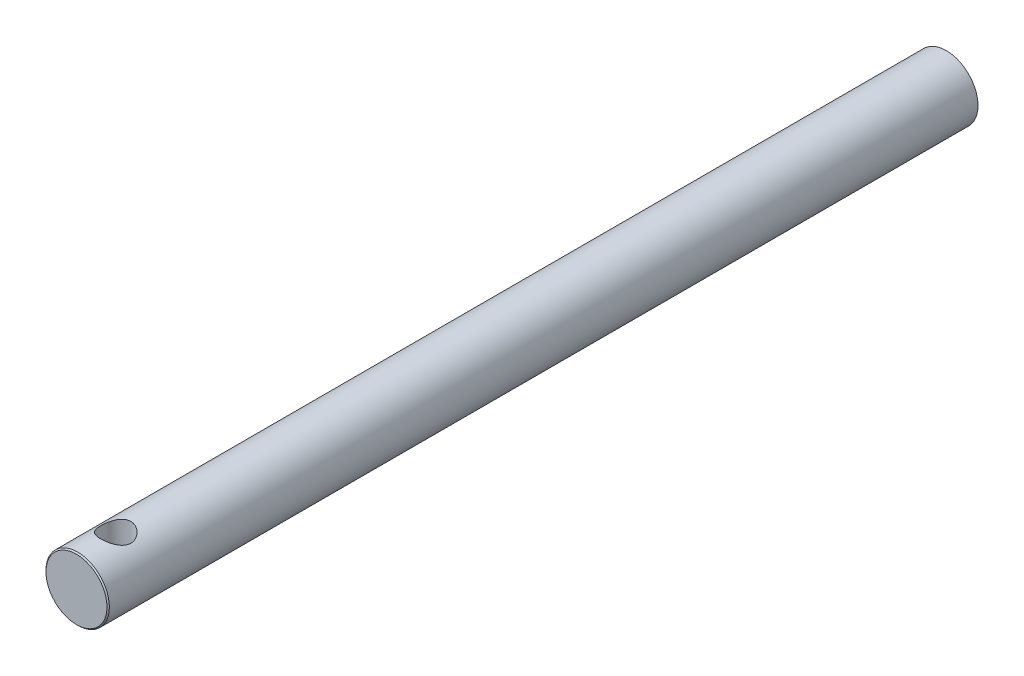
ISO-10303-21;
HEADER;
FILE_DESCRIPTION(('STEP AP214'),'2;1');
FILE_NAME('part.step','',(''),(''),'','','');
FILE_SCHEMA(('AUTOMOTIVE_DESIGN { 1 0 10303 214 1 1 1 1 }'));
ENDSEC;
DATA;
#1=APPLICATION_CONTEXT('core data for automotive mechanical design processes');
#2=APPLICATION_PROTOCOL_DEFINITION('international standard','automotive_design',2000,#1);
#3=PRODUCT_CONTEXT('',#1,'mechanical');
#4=PRODUCT('Part','Part','',(#3));
#5=PRODUCT_RELATED_PRODUCT_CATEGORY('part','',(#4));
#6=PRODUCT_DEFINITION_FORMATION('','',#4);
#7=PRODUCT_DEFINITION_CONTEXT('part definition',#1,'design');
#8=PRODUCT_DEFINITION('design','',#6,#7);
#9=PRODUCT_DEFINITION_SHAPE('','',#8);
#10=(LENGTH_UNIT() NAMED_UNIT(*) SI_UNIT(.MILLI.,.METRE.));
#11=(NAMED_UNIT(*) PLANE_ANGLE_UNIT() SI_UNIT($,.RADIAN.));
#12=(NAMED_UNIT(*) SI_UNIT($,.STERADIAN.) SOLID_ANGLE_UNIT());
#13=UNCERTAINTY_MEASURE_WITH_UNIT(LENGTH_MEASURE(1.E-05),#10,'distance_accuracy_value','');
#14=(GEOMETRIC_REPRESENTATION_CONTEXT(3) GLOBAL_UNCERTAINTY_ASSIGNED_CONTEXT((#13)) GLOBAL_UNIT_ASSIGNED_CONTEXT((#10,
#11,#12)) REPRESENTATION_CONTEXT('',''));
#15=CARTESIAN_POINT('',(0.,0.,0.));
#16=DIRECTION('',(0.,0.,1.));
#17=DIRECTION('',(1.,0.,0.));
#18=AXIS2_PLACEMENT_3D('',#15,#16,#17);
#19=CARTESIAN_POINT('',(0.,0.,144.));
#20=DIRECTION('',(0.,0.,-1.));
#21=DIRECTION('',(-1.,0.,0.));
#22=AXIS2_PLACEMENT_3D('',#19,#20,#21);
#23=CYLINDRICAL_SURFACE('',#22,5.25);
#24=CARTESIAN_POINT('',(0.,-5.25,140.));
#25=CARTESIAN_POINT('',(0.132165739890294,-5.24999266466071,139.999991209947));
#26=CARTESIAN_POINT('',(0.264515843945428,-5.24495416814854,139.989456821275));
#27=CARTESIAN_POINT('',(0.525348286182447,-5.22529487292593,139.947760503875));
#28=CARTESIAN_POINT('',(0.653821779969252,-5.21065367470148,139.916554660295));
#29=CARTESIAN_POINT('',(0.902724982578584,-5.17333218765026,139.834988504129));
#30=CARTESIAN_POINT('',(1.02318293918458,-5.15068212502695,139.784700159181));
#31=CARTESIAN_POINT('',(1.25379564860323,-5.09945780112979,139.666745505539));
#32=CARTESIAN_POINT('',(1.36395186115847,-5.07088438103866,139.599081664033));
#33=CARTESIAN_POINT('',(1.57782560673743,-5.00859887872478,139.443936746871));
#34=CARTESIAN_POINT('',(1.68082998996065,-4.97468790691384,139.355553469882));
#35=CARTESIAN_POINT('',(1.8711994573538,-4.90625773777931,139.163407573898));
#36=CARTESIAN_POINT('',(1.9585538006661,-4.87173814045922,139.059634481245));
#37=CARTESIAN_POINT('',(2.12112928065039,-4.80329266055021,138.831087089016));
#38=CARTESIAN_POINT('',(2.19510684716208,-4.76956998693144,138.705360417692));
#39=CARTESIAN_POINT('',(2.32055549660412,-4.70981783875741,138.441449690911));
#40=CARTESIAN_POINT('',(2.37204145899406,-4.68378328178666,138.303273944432));
#41=CARTESIAN_POINT('',(2.44789372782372,-4.64457285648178,138.026499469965));
#42=CARTESIAN_POINT('',(2.47364073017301,-4.63074762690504,137.888375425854));
#43=CARTESIAN_POINT('',(2.50154637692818,-4.61573890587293,137.609131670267));
#44=CARTESIAN_POINT('',(2.50372468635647,-4.61454487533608,137.468014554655));
#45=CARTESIAN_POINT('',(2.48545049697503,-4.62440209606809,137.202828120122));
#46=CARTESIAN_POINT('',(2.46737110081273,-4.63416946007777,137.07853657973));
#47=CARTESIAN_POINT('',(2.41316672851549,-4.66262302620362,136.835024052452));
#48=CARTESIAN_POINT('',(2.37703683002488,-4.68131166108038,136.71580445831));
#49=CARTESIAN_POINT('',(2.28705880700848,-4.72593088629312,136.482468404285));
#50=CARTESIAN_POINT('',(2.23281876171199,-4.75201955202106,136.368534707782));
#51=CARTESIAN_POINT('',(2.1084508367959,-4.80849184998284,136.150864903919));
#52=CARTESIAN_POINT('',(2.0383159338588,-4.8388773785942,136.047133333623));
#53=CARTESIAN_POINT('',(1.8748403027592,-4.90469972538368,135.840406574));
#54=CARTESIAN_POINT('',(1.7797685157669,-4.94031825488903,135.738833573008));
#55=CARTESIAN_POINT('',(1.57372196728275,-5.00976222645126,135.552514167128));
#56=CARTESIAN_POINT('',(1.46274093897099,-5.04358695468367,135.46777442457));
#57=CARTESIAN_POINT('',(1.22256421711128,-5.10723352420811,135.314505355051));
#58=CARTESIAN_POINT('',(1.09283185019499,-5.13685117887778,135.246725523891));
#59=CARTESIAN_POINT('',(0.822034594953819,-5.18706700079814,135.134477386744));
#60=CARTESIAN_POINT('',(0.680977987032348,-5.20767168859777,135.089992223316));
#61=CARTESIAN_POINT('',(0.403257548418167,-5.23620488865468,135.02896653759));
#62=CARTESIAN_POINT('',(0.26709931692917,-5.24499140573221,135.010528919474));
#63=CARTESIAN_POINT('',(-0.0066428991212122,-5.25177773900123,134.996259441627));
#64=CARTESIAN_POINT('',(-0.144226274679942,-5.24978198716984,135.000418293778));
#65=CARTESIAN_POINT('',(-0.406878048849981,-5.23574931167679,135.030037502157));
#66=CARTESIAN_POINT('',(-0.532156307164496,-5.22441255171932,135.054012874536));
#67=CARTESIAN_POINT('',(-0.776694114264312,-5.19369239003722,135.120335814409));
#68=CARTESIAN_POINT('',(-0.895952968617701,-5.17430806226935,135.162685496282));
#69=CARTESIAN_POINT('',(-1.12919909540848,-5.12854456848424,135.265796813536));
#70=CARTESIAN_POINT('',(-1.24291822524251,-5.10197175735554,135.327076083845));
#71=CARTESIAN_POINT('',(-1.45885691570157,-5.04447644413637,135.465738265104));
#72=CARTESIAN_POINT('',(-1.56107140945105,-5.01355203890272,135.543128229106));
#73=CARTESIAN_POINT('',(-1.7609227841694,-4.94709242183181,135.71996279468));
#74=CARTESIAN_POINT('',(-1.85730015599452,-4.91139355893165,135.820772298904));
#75=CARTESIAN_POINT('',(-2.03227648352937,-4.8416159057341,136.037382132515));
#76=CARTESIAN_POINT('',(-2.11086592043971,-4.80753799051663,136.153190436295));
#77=CARTESIAN_POINT('',(-2.25066382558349,-4.74374815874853,136.402002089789));
#78=CARTESIAN_POINT('',(-2.31112889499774,-4.71424227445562,136.535480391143));
#79=CARTESIAN_POINT('',(-2.40810079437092,-4.66546299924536,136.812590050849));
#80=CARTESIAN_POINT('',(-2.44463543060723,-4.64617773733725,136.956209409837));
#81=CARTESIAN_POINT('',(-2.48958734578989,-4.6222337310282,137.235316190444));
#82=CARTESIAN_POINT('',(-2.50028494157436,-4.61639115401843,137.370333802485));
#83=CARTESIAN_POINT('',(-2.49970377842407,-4.61670761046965,137.640287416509));
#84=CARTESIAN_POINT('',(-2.48843199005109,-4.6228628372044,137.775223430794));
#85=CARTESIAN_POINT('',(-2.44630990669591,-4.64527247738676,138.030028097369));
#86=CARTESIAN_POINT('',(-2.41707425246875,-4.66069188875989,138.150245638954));
#87=CARTESIAN_POINT('',(-2.34171895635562,-4.69900293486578,138.383992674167));
#88=CARTESIAN_POINT('',(-2.29559419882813,-4.72189683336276,138.497520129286));
#89=CARTESIAN_POINT('',(-2.18428055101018,-4.77445699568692,138.723017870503));
#90=CARTESIAN_POINT('',(-2.11802371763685,-4.80447357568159,138.834377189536));
#91=CARTESIAN_POINT('',(-1.96959609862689,-4.86720488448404,139.045095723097));
#92=CARTESIAN_POINT('',(-1.88741759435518,-4.89992091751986,139.144449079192));
#93=CARTESIAN_POINT('',(-1.69920061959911,-4.9685271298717,139.339277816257));
#94=CARTESIAN_POINT('',(-1.59155520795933,-5.00438550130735,139.433221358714));
#95=CARTESIAN_POINT('',(-1.36093741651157,-5.07196241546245,139.601972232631));
#96=CARTESIAN_POINT('',(-1.23795758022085,-5.10367892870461,139.676770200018));
#97=CARTESIAN_POINT('',(-0.97969740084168,-5.15945932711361,139.804525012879));
#98=CARTESIAN_POINT('',(-0.844445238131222,-5.18354020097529,139.857530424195));
#99=CARTESIAN_POINT('',(-0.635554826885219,-5.21186570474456,139.918957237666));
#100=CARTESIAN_POINT('',(-0.564978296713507,-5.22000502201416,139.936412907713));
#101=CARTESIAN_POINT('',(-0.42232921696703,-5.23347401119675,139.965140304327));
#102=CARTESIAN_POINT('',(-0.350257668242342,-5.23880550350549,139.976416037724));
#103=CARTESIAN_POINT('',(-0.231703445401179,-5.24508772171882,139.989671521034));
#104=CARTESIAN_POINT('',(-0.185468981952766,-5.24692689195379,139.993541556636));
#105=CARTESIAN_POINT('',(-0.0928305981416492,-5.24938433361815,139.998707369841));
#106=CARTESIAN_POINT('',(-0.0464266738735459,-5.25000257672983,140.000003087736));
#107=CARTESIAN_POINT('',(0.,-5.25,140.));
#108=B_SPLINE_CURVE_WITH_KNOTS('',3,(#24,#25,#26,#27,#28,#29,#30,#31,#32,#33,#34,#35,#36,#37,
#38,#39,#40,#41,#42,#43,#44,#45,#46,#47,#48,#49,#50,#51,#52,#53,#54,#55,#56,#57,#58,#59,#60,#61,
#62,#63,#64,#65,#66,#67,#68,#69,#70,#71,#72,#73,#74,#75,#76,#77,#78,#79,#80,#81,#82,#83,#84,#85,
#86,#87,#88,#89,#90,#91,#92,#93,#94,#95,#96,#97,#98,#99,#100,#101,#102,#103,#104,#105,#106,
#107),.UNSPECIFIED.,.T.,.F.,(4,2,2,2,2,2,2,2,2,2,2,2,2,2,2,2,2,2,2,2,2,2,2,2,2,2,2,2,2,2,2,2,2,
2,2,2,2,2,2,2,2,4),(0.,0.396316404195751,0.793477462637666,1.18915532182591,1.5847770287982,
2.00270353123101,2.42091577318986,2.86781990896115,3.31442794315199,3.73553405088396,
4.15628877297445,4.53246793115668,4.90874972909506,5.29376840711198,5.6789575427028,
6.10790232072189,6.53701653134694,6.98264766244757,7.42795586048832,7.83878281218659,
8.24944090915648,8.63185033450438,9.01430377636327,9.40831258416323,9.80249424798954,
10.2324870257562,10.6627093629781,11.1087146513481,11.5542007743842,11.9586449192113,
12.362960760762,12.7353812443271,13.1079146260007,13.5053412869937,13.9029610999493,
14.3427993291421,14.7828522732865,15.2219191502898,15.4411213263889,15.6601812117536,
15.7993944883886,15.9386109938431),.UNSPECIFIED.);
#109=CARTESIAN_POINT('',(0.,-5.25,140.));
#110=VERTEX_POINT('',#109);
#111=EDGE_CURVE('E10',#110,#110,#108,.T.);
#112=ORIENTED_EDGE('',*,*,#111,.T.);
#113=EDGE_LOOP('',(#112));
#114=FACE_BOUND('',#113,.T.);
#115=CARTESIAN_POINT('',(0.,5.25,140.));
#116=CARTESIAN_POINT('',(-0.132165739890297,5.2499926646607,139.999991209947));
#117=CARTESIAN_POINT('',(-0.26451584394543,5.24495416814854,139.989456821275));
#118=CARTESIAN_POINT('',(-0.525348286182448,5.22529487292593,139.947760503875));
#119=CARTESIAN_POINT('',(-0.653821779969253,5.21065367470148,139.916554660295));
#120=CARTESIAN_POINT('',(-0.902724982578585,5.17333218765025,139.834988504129));
#121=CARTESIAN_POINT('',(-1.02318293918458,5.15068212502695,139.784700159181));
#122=CARTESIAN_POINT('',(-1.25379564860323,5.09945780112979,139.666745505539));
#123=CARTESIAN_POINT('',(-1.36395186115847,5.07088438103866,139.599081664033));
#124=CARTESIAN_POINT('',(-1.57782560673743,5.00859887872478,139.443936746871));
#125=CARTESIAN_POINT('',(-1.68082998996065,4.97468790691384,139.355553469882));
#126=CARTESIAN_POINT('',(-1.87119945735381,4.90625773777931,139.163407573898));
#127=CARTESIAN_POINT('',(-1.9585538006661,4.87173814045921,139.059634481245));
#128=CARTESIAN_POINT('',(-2.12112928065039,4.80329266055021,138.831087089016));
#129=CARTESIAN_POINT('',(-2.19510684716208,4.76956998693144,138.705360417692));
#130=CARTESIAN_POINT('',(-2.32055549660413,4.70981783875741,138.441449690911));
#131=CARTESIAN_POINT('',(-2.37204145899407,4.68378328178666,138.303273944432));
#132=CARTESIAN_POINT('',(-2.44789372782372,4.64457285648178,138.026499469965));
#133=CARTESIAN_POINT('',(-2.47364073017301,4.63074762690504,137.888375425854));
#134=CARTESIAN_POINT('',(-2.50154637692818,4.61573890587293,137.609131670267));
#135=CARTESIAN_POINT('',(-2.50372468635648,4.61454487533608,137.468014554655));
#136=CARTESIAN_POINT('',(-2.48545049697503,4.62440209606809,137.202828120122));
#137=CARTESIAN_POINT('',(-2.46737110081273,4.63416946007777,137.07853657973));
#138=CARTESIAN_POINT('',(-2.41316672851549,4.66262302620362,136.835024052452));
#139=CARTESIAN_POINT('',(-2.37703683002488,4.68131166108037,136.71580445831));
#140=CARTESIAN_POINT('',(-2.28705880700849,4.72593088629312,136.482468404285));
#141=CARTESIAN_POINT('',(-2.232818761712,4.75201955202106,136.368534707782));
#142=CARTESIAN_POINT('',(-2.1084508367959,4.80849184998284,136.150864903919));
#143=CARTESIAN_POINT('',(-2.0383159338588,4.8388773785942,136.047133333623));
#144=CARTESIAN_POINT('',(-1.87484030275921,4.90469972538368,135.840406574));
#145=CARTESIAN_POINT('',(-1.77976851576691,4.94031825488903,135.738833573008));
#146=CARTESIAN_POINT('',(-1.57372196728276,5.00976222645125,135.552514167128));
#147=CARTESIAN_POINT('',(-1.462740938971,5.04358695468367,135.46777442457));
#148=CARTESIAN_POINT('',(-1.22256421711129,5.10723352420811,135.314505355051));
#149=CARTESIAN_POINT('',(-1.092831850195,5.13685117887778,135.246725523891));
#150=CARTESIAN_POINT('',(-0.822034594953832,5.18706700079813,135.134477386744));
#151=CARTESIAN_POINT('',(-0.680977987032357,5.20767168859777,135.089992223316));
#152=CARTESIAN_POINT('',(-0.403257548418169,5.23620488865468,135.02896653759));
#153=CARTESIAN_POINT('',(-0.267099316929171,5.24499140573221,135.010528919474));
#154=CARTESIAN_POINT('',(0.00664289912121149,5.25177773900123,134.996259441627));
#155=CARTESIAN_POINT('',(0.144226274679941,5.24978198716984,135.000418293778));
#156=CARTESIAN_POINT('',(0.406878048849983,5.23574931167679,135.030037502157));
#157=CARTESIAN_POINT('',(0.5321563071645,5.22441255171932,135.054012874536));
#158=CARTESIAN_POINT('',(0.776694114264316,5.19369239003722,135.120335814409));
#159=CARTESIAN_POINT('',(0.895952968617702,5.17430806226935,135.162685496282));
#160=CARTESIAN_POINT('',(1.12919909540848,5.12854456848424,135.265796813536));
#161=CARTESIAN_POINT('',(1.24291822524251,5.10197175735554,135.327076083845));
#162=CARTESIAN_POINT('',(1.45885691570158,5.04447644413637,135.465738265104));
#163=CARTESIAN_POINT('',(1.56107140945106,5.01355203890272,135.543128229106));
#164=CARTESIAN_POINT('',(1.7609227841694,4.94709242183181,135.71996279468));
#165=CARTESIAN_POINT('',(1.85730015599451,4.91139355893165,135.820772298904));
#166=CARTESIAN_POINT('',(2.03227648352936,4.84161590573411,136.037382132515));
#167=CARTESIAN_POINT('',(2.1108659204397,4.80753799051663,136.153190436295));
#168=CARTESIAN_POINT('',(2.25066382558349,4.74374815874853,136.402002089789));
#169=CARTESIAN_POINT('',(2.31112889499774,4.71424227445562,136.535480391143));
#170=CARTESIAN_POINT('',(2.40810079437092,4.66546299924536,136.812590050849));
#171=CARTESIAN_POINT('',(2.44463543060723,4.64617773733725,136.956209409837));
#172=CARTESIAN_POINT('',(2.48958734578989,4.6222337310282,137.235316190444));
#173=CARTESIAN_POINT('',(2.50028494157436,4.61639115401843,137.370333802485));
#174=CARTESIAN_POINT('',(2.49970377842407,4.61670761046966,137.640287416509));
#175=CARTESIAN_POINT('',(2.48843199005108,4.6228628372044,137.775223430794));
#176=CARTESIAN_POINT('',(2.4463099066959,4.64527247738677,138.030028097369));
#177=CARTESIAN_POINT('',(2.41707425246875,4.66069188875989,138.150245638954));
#178=CARTESIAN_POINT('',(2.34171895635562,4.69900293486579,138.383992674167));
#179=CARTESIAN_POINT('',(2.29559419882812,4.72189683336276,138.497520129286));
#180=CARTESIAN_POINT('',(2.18428055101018,4.77445699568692,138.723017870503));
#181=CARTESIAN_POINT('',(2.11802371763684,4.80447357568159,138.834377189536));
#182=CARTESIAN_POINT('',(1.96959609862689,4.86720488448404,139.045095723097));
#183=CARTESIAN_POINT('',(1.88741759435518,4.89992091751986,139.144449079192));
#184=CARTESIAN_POINT('',(1.69920061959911,4.9685271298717,139.339277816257));
#185=CARTESIAN_POINT('',(1.59155520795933,5.00438550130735,139.433221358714));
#186=CARTESIAN_POINT('',(1.36093741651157,5.07196241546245,139.601972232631));
#187=CARTESIAN_POINT('',(1.23795758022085,5.10367892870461,139.676770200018));
#188=CARTESIAN_POINT('',(0.979697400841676,5.15945932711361,139.804525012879));
#189=CARTESIAN_POINT('',(0.844445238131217,5.18354020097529,139.857530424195));
#190=CARTESIAN_POINT('',(0.635554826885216,5.21186570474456,139.918957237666));
#191=CARTESIAN_POINT('',(0.564978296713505,5.22000502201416,139.936412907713));
#192=CARTESIAN_POINT('',(0.422329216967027,5.23347401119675,139.965140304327));
#193=CARTESIAN_POINT('',(0.350257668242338,5.23880550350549,139.976416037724));
#194=CARTESIAN_POINT('',(0.231703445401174,5.24508772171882,139.989671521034));
#195=CARTESIAN_POINT('',(0.185468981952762,5.24692689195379,139.993541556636));
#196=CARTESIAN_POINT('',(0.092830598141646,5.24938433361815,139.998707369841));
#197=CARTESIAN_POINT('',(0.0464266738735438,5.25000257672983,140.000003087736));
#198=CARTESIAN_POINT('',(0.,5.25,140.));
#199=B_SPLINE_CURVE_WITH_KNOTS('',3,(#115,#116,#117,#118,#119,#120,#121,#122,#123,#124,#125,
#126,#127,#128,#129,#130,#131,#132,#133,#134,#135,#136,#137,#138,#139,#140,#141,#142,#143,#144,
#145,#146,#147,#148,#149,#150,#151,#152,#153,#154,#155,#156,#157,#158,#159,#160,#161,#162,#163,
#164,#165,#166,#167,#168,#169,#170,#171,#172,#173,#174,#175,#176,#177,#178,#179,#180,#181,#182,
#183,#184,#185,#186,#187,#188,#189,#190,#191,#192,#193,#194,#195,#196,#197,#198),.UNSPECIFIED.,
.T.,.F.,(4,2,2,2,2,2,2,2,2,2,2,2,2,2,2,2,2,2,2,2,2,2,2,2,2,2,2,2,2,2,2,2,2,2,2,2,2,2,2,2,2,4),
(0.,0.396316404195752,0.793477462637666,1.18915532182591,1.5847770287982,2.00270353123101,
2.42091577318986,2.86781990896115,3.31442794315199,3.7355340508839,4.15628877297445,
4.53246793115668,4.90874972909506,5.29376840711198,5.6789575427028,6.10790232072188,
6.53701653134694,6.98264766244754,7.42795586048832,7.83878281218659,8.24944090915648,
8.63185033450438,9.01430377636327,9.40831258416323,9.80249424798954,10.2324870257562,
10.6627093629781,11.1087146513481,11.5542007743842,11.9586449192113,12.362960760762,
12.7353812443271,13.1079146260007,13.5053412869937,13.9029610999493,14.3427993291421,
14.7828522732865,15.2219191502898,15.4411213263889,15.6601812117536,15.7993944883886,
15.9386109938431),.UNSPECIFIED.);
#200=CARTESIAN_POINT('',(0.,5.25,140.));
#201=VERTEX_POINT('',#200);
#202=EDGE_CURVE('E34',#201,#201,#199,.T.);
#203=ORIENTED_EDGE('',*,*,#202,.T.);
#204=EDGE_LOOP('',(#203));
#205=FACE_BOUND('',#204,.T.);
#206=CARTESIAN_POINT('',(0.,0.,143.8));
#207=DIRECTION('',(0.,0.,1.));
#208=DIRECTION('',(1.,0.,0.));
#209=AXIS2_PLACEMENT_3D('',#206,#207,#208);
#210=CIRCLE('',#209,5.25);
#211=CARTESIAN_POINT('',(5.25,0.,143.8));
#212=VERTEX_POINT('',#211);
#213=EDGE_CURVE('E38',#212,#212,#210,.F.);
#214=ORIENTED_EDGE('',*,*,#213,.T.);
#215=EDGE_LOOP('',(#214));
#216=FACE_BOUND('',#215,.T.);
#217=CARTESIAN_POINT('',(0.,0.,0.));
#218=DIRECTION('',(0.,0.,1.));
#219=DIRECTION('',(1.,0.,0.));
#220=AXIS2_PLACEMENT_3D('',#217,#218,#219);
#221=CIRCLE('',#220,5.25);
#222=CARTESIAN_POINT('',(5.25,0.,0.));
#223=VERTEX_POINT('',#222);
#224=EDGE_CURVE('E69',#223,#223,#221,.T.);
#225=ORIENTED_EDGE('',*,*,#224,.T.);
#226=EDGE_LOOP('',(#225));
#227=FACE_BOUND('',#226,.T.);
#228=ADVANCED_FACE('F24',(#114,#205,#216,#227),#23,.T.);
#229=CARTESIAN_POINT('',(0.,0.,144.));
#230=DIRECTION('',(0.,0.,1.));
#231=DIRECTION('',(1.,0.,0.));
#232=AXIS2_PLACEMENT_3D('',#229,#230,#231);
#233=PLANE('',#232);
#234=CARTESIAN_POINT('',(0.,0.,144.));
#235=DIRECTION('',(0.,0.,1.));
#236=DIRECTION('',(1.,0.,0.));
#237=AXIS2_PLACEMENT_3D('',#234,#235,#236);
#238=CIRCLE('',#237,5.05);
#239=CARTESIAN_POINT('',(5.05,0.,144.));
#240=VERTEX_POINT('',#239);
#241=EDGE_CURVE('E42',#240,#240,#238,.T.);
#242=ORIENTED_EDGE('',*,*,#241,.T.);
#243=EDGE_LOOP('',(#242));
#244=FACE_BOUND('',#243,.T.);
#245=ADVANCED_FACE('F59',(#244),#233,.T.);
#246=CARTESIAN_POINT('',(0.,0.,0.));
#247=DIRECTION('',(0.,0.,1.));
#248=DIRECTION('',(1.,0.,0.));
#249=AXIS2_PLACEMENT_3D('',#246,#247,#248);
#250=PLANE('',#249);
#251=ORIENTED_EDGE('',*,*,#224,.F.);
#252=EDGE_LOOP('',(#251));
#253=FACE_BOUND('',#252,.T.);
#254=ADVANCED_FACE('F56',(#253),#250,.F.);
#255=CARTESIAN_POINT('',(0.,0.,144.));
#256=DIRECTION('',(0.,0.,-1.));
#257=DIRECTION('',(-1.,0.,0.));
#258=AXIS2_PLACEMENT_3D('',#255,#256,#257);
#259=CONICAL_SURFACE('',#258,5.05,0.785398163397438);
#260=ORIENTED_EDGE('',*,*,#213,.F.);
#261=EDGE_LOOP('',(#260));
#262=FACE_BOUND('',#261,.T.);
#263=ORIENTED_EDGE('',*,*,#241,.F.);
#264=EDGE_LOOP('',(#263));
#265=FACE_BOUND('',#264,.T.);
#266=ADVANCED_FACE('F51',(#262,#265),#259,.T.);
#267=CARTESIAN_POINT('',(0.,-5.25,137.5));
#268=DIRECTION('',(0.,1.,0.));
#269=DIRECTION('',(0.,0.,1.));
#270=AXIS2_PLACEMENT_3D('',#267,#268,#269);
#271=CYLINDRICAL_SURFACE('',#270,2.5);
#272=ORIENTED_EDGE('',*,*,#202,.F.);
#273=EDGE_LOOP('',(#272));
#274=FACE_BOUND('',#273,.T.);
#275=ORIENTED_EDGE('',*,*,#111,.F.);
#276=EDGE_LOOP('',(#275));
#277=FACE_BOUND('',#276,.T.);
#278=ADVANCED_FACE('F47',(#274,#277),#271,.F.);
#279=CLOSED_SHELL('',(#228,#245,#254,#266,#278));
#280=MANIFOLD_SOLID_BREP('B2',#279);
#281=ADVANCED_BREP_SHAPE_REPRESENTATION('',(#18,#280),#14);
#282=SHAPE_DEFINITION_REPRESENTATION(#9,#281);
ENDSEC;
END-ISO-10303-21;
